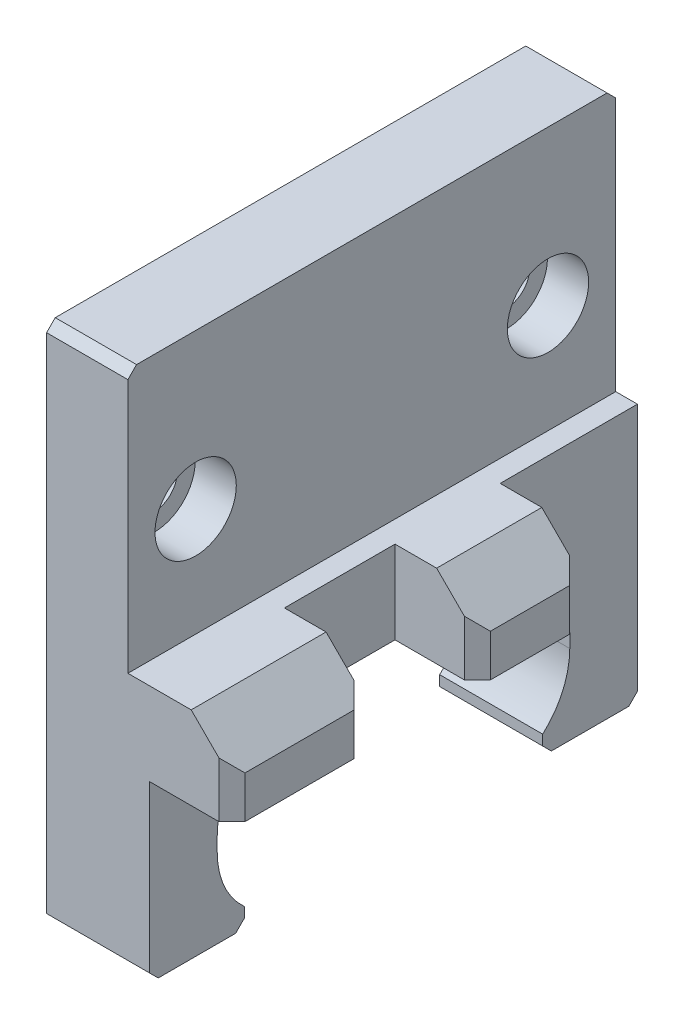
from build123d import *

# Parameters (mm, degrees)
BASE_EXTRUDE_DEPTH                              = 28.575
CUT_EXTRUDE1_DEPTH                              = 62.457183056
CHAMFER1_SIZE                                   = 1.016
SKETCH5_W                                       = 9.652
SKETCH5_H                                       = 12.954
SKETCH5_H_2                                     = 16.0782
LOCK_CUT_EXTRUDE4_DEPTH                         = 53.467266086
CHAMFER2_SIZE                                   = 1.524
CHAMFER4_SIZE                                   = 4.7752
CBORE_FOR_10_SOCKET_HEAD_CAP_SCREW1_D           = 5.334
CBORE_FOR_10_SOCKET_HEAD_CAP_SCREW1_CBORE_D     = 9.525
CBORE_FOR_10_SOCKET_HEAD_CAP_SCREW1_CBORE_DEPTH = 4.826


with BuildPart() as part:
    # Sketch1 → Base-Extrude (new, symmetric)
    with BuildSketch(Plane.XY):
        Polygon((-17.145, -9.3218), (-17.145, 51.6382), (-7.62, 51.6382), (-7.62, 20.828), (4.572, 20.828), (4.572, 11.1125), (-5.08, 11.1125), (-5.08, -9.3218), align=None)
    extrude(amount=BASE_EXTRUDE_DEPTH, both=True)

    # Sketch2 → Cut-Extrude1 (cut, through all)
    with BuildSketch(Plane(origin=(0, 0, 0), x_dir=(0, 0, -1), z_dir=(1, 0, 0))):
        with BuildLine():
            Line((-17.4752, -9.3218), (17.4752, -9.3218))
            Line((17.4752, -9.3218), (17.4752, -7.099515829))
            ThreePointArc((17.4752, -7.099515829), (19.8202956, -3.888564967), (20.6502, 0))
            Line((20.6502, 0), (20.6502, 1.5875))
            ThreePointArc((20.6502, 1.5875), (17.860392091, 8.322692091), (11.1252, 11.1125))
            Line((11.1252, 11.1125), (-11.1252, 11.1125))
            ThreePointArc((-11.1252, 11.1125), (-17.860392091, 8.322692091), (-20.6502, 1.5875))
            Line((-20.6502, 1.5875), (-20.6502, 0))
            ThreePointArc((-20.6502, 0), (-19.8202956, -3.888564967), (-17.4752, -7.099515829))
            Line((-17.4752, -7.099515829), (-17.4752, -9.3218))
        make_face()
    extrude(amount=-CUT_EXTRUDE1_DEPTH, mode=Mode.SUBTRACT)

    # Chamfer1
    chamfer1_edges = [part.edges().sort_by_distance(p)[0] for p in [
        (-12.3825, 51.6382, 28.575),
        (-11.1125, -9.3218, 17.4752),
        (-11.1125, -9.3218, -17.4752),
        (-11.1125, -9.3218, 28.575),
        (-12.3825, 51.6382, -28.575),
        (-11.1125, -9.3218, -28.575),
    ]]
    chamfer(chamfer1_edges, length=CHAMFER1_SIZE)

    # Sketch5 → Lock Cut-Extrude4 (cut, through all)
    with BuildSketch(Plane.XZ.offset(-11.1125)):
        with Locations((-0.254, 6.2992)):
            Rectangle(SKETCH5_W, SKETCH5_H)
        with Locations((-0.254, -20.5359)):
            Rectangle(SKETCH5_W, SKETCH5_H_2)
    extrude(amount=-LOCK_CUT_EXTRUDE4_DEPTH, mode=Mode.SUBTRACT)

    # Chamfer2
    chamfer2_edges = [part.edges().sort_by_distance(p)[0] for p in [
        (4.572, 15.97025, 12.7762),
        (4.572, 15.97025, -0.1778),
        (4.572, 15.97025, -12.4968),
        (4.572, 15.97025, 28.575),
    ]]
    chamfer(chamfer2_edges, length=CHAMFER2_SIZE)

    # Chamfer4
    chamfer4_edges = [part.edges().sort_by_distance(p)[0] for p in [
        (4.572, 20.828, 20.6756),
        (4.572, 20.828, -6.3373),
    ]]
    chamfer(chamfer4_edges, length=CHAMFER4_SIZE)

    # CBORE for _10 Socket Head Cap Screw1 (through all)
    with Locations(Plane(origin=(-7.62, 0, 0), x_dir=(0, 0, -1), z_dir=(1, 0, 0))):
        with Locations((20.6375, 33.528), (-20.6375, 33.528)):
            CounterBoreHole(CBORE_FOR_10_SOCKET_HEAD_CAP_SCREW1_D / 2, CBORE_FOR_10_SOCKET_HEAD_CAP_SCREW1_CBORE_D / 2, CBORE_FOR_10_SOCKET_HEAD_CAP_SCREW1_CBORE_DEPTH)


solid = part.part
